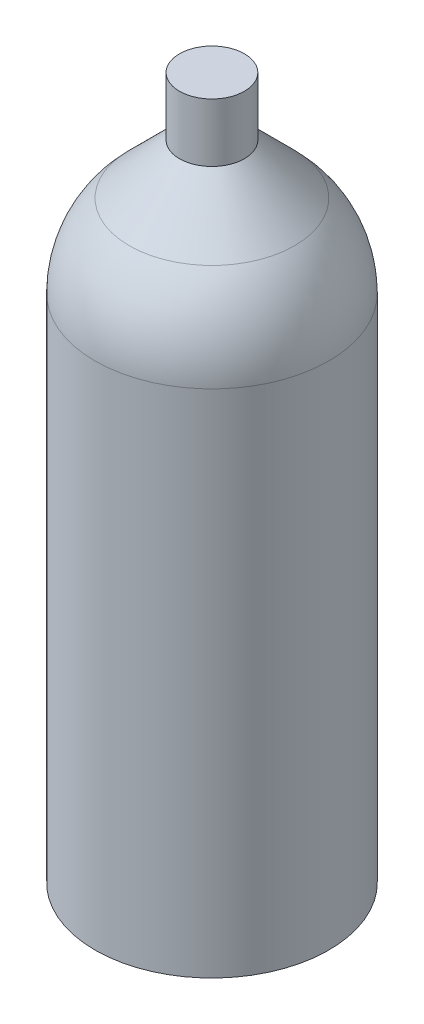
ISO-10303-21;
HEADER;
FILE_DESCRIPTION(('STEP AP214'),'2;1');
FILE_NAME('part.step','',(''),(''),'','','');
FILE_SCHEMA(('AUTOMOTIVE_DESIGN { 1 0 10303 214 1 1 1 1 }'));
ENDSEC;
DATA;
#1=APPLICATION_CONTEXT('core data for automotive mechanical design processes');
#2=APPLICATION_PROTOCOL_DEFINITION('international standard','automotive_design',2000,#1);
#3=PRODUCT_CONTEXT('',#1,'mechanical');
#4=PRODUCT('Part','Part','',(#3));
#5=PRODUCT_RELATED_PRODUCT_CATEGORY('part','',(#4));
#6=PRODUCT_DEFINITION_FORMATION('','',#4);
#7=PRODUCT_DEFINITION_CONTEXT('part definition',#1,'design');
#8=PRODUCT_DEFINITION('design','',#6,#7);
#9=PRODUCT_DEFINITION_SHAPE('','',#8);
#10=(LENGTH_UNIT() NAMED_UNIT(*) SI_UNIT(.MILLI.,.METRE.));
#11=(NAMED_UNIT(*) PLANE_ANGLE_UNIT() SI_UNIT($,.RADIAN.));
#12=(NAMED_UNIT(*) SI_UNIT($,.STERADIAN.) SOLID_ANGLE_UNIT());
#13=UNCERTAINTY_MEASURE_WITH_UNIT(LENGTH_MEASURE(1.E-05),#10,'distance_accuracy_value','');
#14=(GEOMETRIC_REPRESENTATION_CONTEXT(3) GLOBAL_UNCERTAINTY_ASSIGNED_CONTEXT((#13)) GLOBAL_UNIT_ASSIGNED_CONTEXT((#10,
#11,#12)) REPRESENTATION_CONTEXT('',''));
#15=CARTESIAN_POINT('',(0.,0.,0.));
#16=DIRECTION('',(0.,0.,1.));
#17=DIRECTION('',(1.,0.,0.));
#18=AXIS2_PLACEMENT_3D('',#15,#16,#17);
#19=CARTESIAN_POINT('',(0.,60.,0.));
#20=DIRECTION('',(0.,-1.,0.));
#21=DIRECTION('',(0.,0.,-1.));
#22=AXIS2_PLACEMENT_3D('',#19,#20,#21);
#23=PLANE('',#22);
#24=CARTESIAN_POINT('',(0.,60.,0.));
#25=DIRECTION('',(0.,1.,0.));
#26=DIRECTION('',(0.,0.,1.));
#27=AXIS2_PLACEMENT_3D('',#24,#25,#26);
#28=CIRCLE('',#27,2.7760637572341);
#29=CARTESIAN_POINT('',(0.,60.,2.7760637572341));
#30=VERTEX_POINT('',#29);
#31=EDGE_CURVE('E42',#30,#30,#28,.T.);
#32=ORIENTED_EDGE('',*,*,#31,.T.);
#33=EDGE_LOOP('',(#32));
#34=FACE_BOUND('',#33,.T.);
#35=ADVANCED_FACE('F31',(#34),#23,.F.);
#36=CARTESIAN_POINT('',(0.,67.5739644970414,0.));
#37=DIRECTION('',(0.,1.,0.));
#38=DIRECTION('',(0.,0.,1.));
#39=AXIS2_PLACEMENT_3D('',#36,#37,#38);
#40=CYLINDRICAL_SURFACE('',#39,2.7760637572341);
#41=ORIENTED_EDGE('',*,*,#31,.F.);
#42=EDGE_LOOP('',(#41));
#43=FACE_BOUND('',#42,.T.);
#44=CARTESIAN_POINT('',(0.,55.,0.));
#45=DIRECTION('',(0.,1.,0.));
#46=DIRECTION('',(0.,0.,1.));
#47=AXIS2_PLACEMENT_3D('',#44,#45,#46);
#48=CIRCLE('',#47,2.7760637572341);
#49=CARTESIAN_POINT('',(0.,55.,2.7760637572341));
#50=VERTEX_POINT('',#49);
#51=EDGE_CURVE('E46',#50,#50,#48,.T.);
#52=ORIENTED_EDGE('',*,*,#51,.T.);
#53=EDGE_LOOP('',(#52));
#54=FACE_BOUND('',#53,.T.);
#55=ADVANCED_FACE('F68',(#43,#54),#40,.T.);
#56=CARTESIAN_POINT('',(0.,47.7760637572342,0.));
#57=DIRECTION('',(0.,-1.,0.));
#58=DIRECTION('',(0.,0.,-1.));
#59=AXIS2_PLACEMENT_3D('',#56,#57,#58);
#60=CONICAL_SURFACE('',#59,9.99999999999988,0.785398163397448);
#61=CARTESIAN_POINT('',(0.,50.7049959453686,0.));
#62=DIRECTION('',(0.,-1.,0.));
#63=DIRECTION('',(0.,0.,-1.));
#64=AXIS2_PLACEMENT_3D('',#61,#62,#63);
#65=CIRCLE('',#64,7.07106781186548);
#66=CARTESIAN_POINT('',(0.,50.7049959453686,-7.07106781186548));
#67=VERTEX_POINT('',#66);
#68=EDGE_CURVE('E38',#67,#67,#65,.F.);
#69=ORIENTED_EDGE('',*,*,#68,.T.);
#70=EDGE_LOOP('',(#69));
#71=FACE_BOUND('',#70,.T.);
#72=ORIENTED_EDGE('',*,*,#51,.F.);
#73=EDGE_LOOP('',(#72));
#74=FACE_BOUND('',#73,.T.);
#75=ADVANCED_FACE('F65',(#71,#74),#60,.T.);
#76=CARTESIAN_POINT('',(0.,67.5739644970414,0.));
#77=DIRECTION('',(0.,1.,0.));
#78=DIRECTION('',(0.,0.,1.));
#79=AXIS2_PLACEMENT_3D('',#76,#77,#78);
#80=CYLINDRICAL_SURFACE('',#79,9.99999999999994);
#81=CARTESIAN_POINT('',(0.,43.6339281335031,0.));
#82=DIRECTION('',(0.,1.,0.));
#83=DIRECTION('',(0.,0.,1.));
#84=AXIS2_PLACEMENT_3D('',#81,#82,#83);
#85=CIRCLE('',#84,9.99999999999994);
#86=CARTESIAN_POINT('',(0.,43.6339281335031,9.99999999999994));
#87=VERTEX_POINT('',#86);
#88=EDGE_CURVE('E10',#87,#87,#85,.F.);
#89=ORIENTED_EDGE('',*,*,#88,.T.);
#90=EDGE_LOOP('',(#89));
#91=FACE_BOUND('',#90,.T.);
#92=CARTESIAN_POINT('',(0.,0.,0.));
#93=DIRECTION('',(0.,1.,0.));
#94=DIRECTION('',(0.,0.,1.));
#95=AXIS2_PLACEMENT_3D('',#92,#93,#94);
#96=CIRCLE('',#95,10.);
#97=CARTESIAN_POINT('',(0.,0.,10.));
#98=VERTEX_POINT('',#97);
#99=EDGE_CURVE('E51',#98,#98,#96,.T.);
#100=ORIENTED_EDGE('',*,*,#99,.T.);
#101=EDGE_LOOP('',(#100));
#102=FACE_BOUND('',#101,.T.);
#103=ADVANCED_FACE('F55',(#91,#102),#80,.T.);
#104=CARTESIAN_POINT('',(0.,0.,0.));
#105=DIRECTION('',(0.,1.,0.));
#106=DIRECTION('',(0.,0.,1.));
#107=AXIS2_PLACEMENT_3D('',#104,#105,#106);
#108=PLANE('',#107);
#109=ORIENTED_EDGE('',*,*,#99,.F.);
#110=EDGE_LOOP('',(#109));
#111=FACE_BOUND('',#110,.T.);
#112=ADVANCED_FACE('F57',(#111),#108,.F.);
#113=CARTESIAN_POINT('',(0.,43.6339281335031,0.));
#114=DIRECTION('',(0.,0.,1.));
#115=DIRECTION('',(1.,0.,0.));
#116=AXIS2_PLACEMENT_3D('',#113,#114,#115);
#117=SPHERICAL_SURFACE('',#116,10.);
#118=CARTESIAN_POINT('',(0.,43.6339281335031,0.));
#119=DIRECTION('',(0.,1.,0.));
#120=DIRECTION('',(0.,0.,1.));
#121=AXIS2_PLACEMENT_3D('',#118,#119,#120);
#122=SPHERICAL_SURFACE('',#121,10.);
#123=ORIENTED_EDGE('',*,*,#88,.F.);
#124=EDGE_LOOP('',(#123));
#125=FACE_BOUND('',#124,.T.);
#126=ORIENTED_EDGE('',*,*,#68,.F.);
#127=EDGE_LOOP('',(#126));
#128=FACE_BOUND('',#127,.T.);
#129=ADVANCED_FACE('F33',(#125,#128),#122,.T.);
#130=CLOSED_SHELL('',(#35,#55,#75,#103,#112,#129));
#131=MANIFOLD_SOLID_BREP('B2',#130);
#132=ADVANCED_BREP_SHAPE_REPRESENTATION('',(#18,#131),#14);
#133=SHAPE_DEFINITION_REPRESENTATION(#9,#132);
ENDSEC;
END-ISO-10303-21;
